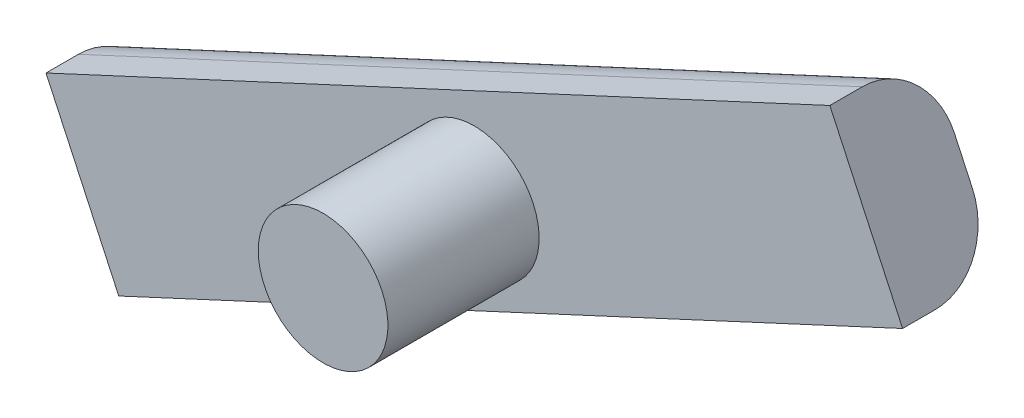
ISO-10303-21;
HEADER;
FILE_DESCRIPTION(('STEP AP214'),'2;1');
FILE_NAME('part.step','',(''),(''),'','','');
FILE_SCHEMA(('AUTOMOTIVE_DESIGN { 1 0 10303 214 1 1 1 1 }'));
ENDSEC;
DATA;
#1=APPLICATION_CONTEXT('core data for automotive mechanical design processes');
#2=APPLICATION_PROTOCOL_DEFINITION('international standard','automotive_design',2000,#1);
#3=PRODUCT_CONTEXT('',#1,'mechanical');
#4=PRODUCT('Part','Part','',(#3));
#5=PRODUCT_RELATED_PRODUCT_CATEGORY('part','',(#4));
#6=PRODUCT_DEFINITION_FORMATION('','',#4);
#7=PRODUCT_DEFINITION_CONTEXT('part definition',#1,'design');
#8=PRODUCT_DEFINITION('design','',#6,#7);
#9=PRODUCT_DEFINITION_SHAPE('','',#8);
#10=(LENGTH_UNIT() NAMED_UNIT(*) SI_UNIT(.MILLI.,.METRE.));
#11=(NAMED_UNIT(*) PLANE_ANGLE_UNIT() SI_UNIT($,.RADIAN.));
#12=(NAMED_UNIT(*) SI_UNIT($,.STERADIAN.) SOLID_ANGLE_UNIT());
#13=UNCERTAINTY_MEASURE_WITH_UNIT(LENGTH_MEASURE(1.E-05),#10,'distance_accuracy_value','');
#14=(GEOMETRIC_REPRESENTATION_CONTEXT(3) GLOBAL_UNCERTAINTY_ASSIGNED_CONTEXT((#13)) GLOBAL_UNIT_ASSIGNED_CONTEXT((#10,
#11,#12)) REPRESENTATION_CONTEXT('',''));
#15=CARTESIAN_POINT('',(0.,0.,0.));
#16=DIRECTION('',(0.,0.,1.));
#17=DIRECTION('',(1.,0.,0.));
#18=AXIS2_PLACEMENT_3D('',#15,#16,#17);
#19=CARTESIAN_POINT('',(455.341566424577,345.362620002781,22.));
#20=DIRECTION('',(0.,0.,-1.));
#21=DIRECTION('',(-1.,0.,0.));
#22=AXIS2_PLACEMENT_3D('',#19,#20,#21);
#23=PLANE('',#22);
#24=CARTESIAN_POINT('',(455.341566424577,345.362620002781,22.));
#25=DIRECTION('',(0.,0.,-1.));
#26=DIRECTION('',(-1.,0.,0.));
#27=AXIS2_PLACEMENT_3D('',#24,#25,#26);
#28=CIRCLE('',#27,3.);
#29=CARTESIAN_POINT('',(452.341566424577,345.362620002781,22.));
#30=VERTEX_POINT('',#29);
#31=EDGE_CURVE('E117',#30,#30,#28,.T.);
#32=ORIENTED_EDGE('',*,*,#31,.F.);
#33=EDGE_LOOP('',(#32));
#34=FACE_BOUND('',#33,.T.);
#35=ADVANCED_FACE('F40',(#34),#23,.F.);
#36=CARTESIAN_POINT('',(455.341566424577,345.362620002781,22.));
#37=DIRECTION('',(0.,0.,-1.));
#38=DIRECTION('',(-1.,0.,0.));
#39=AXIS2_PLACEMENT_3D('',#36,#37,#38);
#40=CYLINDRICAL_SURFACE('',#39,3.);
#41=CARTESIAN_POINT('',(455.341566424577,345.362620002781,15.));
#42=DIRECTION('',(0.,0.,-1.));
#43=DIRECTION('',(-1.,0.,0.));
#44=AXIS2_PLACEMENT_3D('',#41,#42,#43);
#45=CIRCLE('',#44,3.);
#46=CARTESIAN_POINT('',(452.341566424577,345.362620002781,15.));
#47=VERTEX_POINT('',#46);
#48=EDGE_CURVE('E120',#47,#47,#45,.T.);
#49=ORIENTED_EDGE('',*,*,#48,.F.);
#50=EDGE_LOOP('',(#49));
#51=FACE_BOUND('',#50,.T.);
#52=ORIENTED_EDGE('',*,*,#31,.T.);
#53=EDGE_LOOP('',(#52));
#54=FACE_BOUND('',#53,.T.);
#55=ADVANCED_FACE('F162',(#51,#54),#40,.T.);
#56=CARTESIAN_POINT('',(475.166946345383,350.153685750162,15.));
#57=DIRECTION('',(-0.420968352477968,0.907075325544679,0.));
#58=DIRECTION('',(-0.907075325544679,-0.420968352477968,0.));
#59=AXIS2_PLACEMENT_3D('',#56,#57,#58);
#60=PLANE('',#59);
#61=DIRECTION('',(0.,0.,-1.));
#62=VECTOR('',#61,1.);
#63=CARTESIAN_POINT('',(438.883933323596,333.314951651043,15.));
#64=LINE('',#63,#62);
#65=CARTESIAN_POINT('',(438.883933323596,333.314951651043,15.));
#66=VERTEX_POINT('',#65);
#67=CARTESIAN_POINT('',(438.883933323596,333.314951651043,13.5));
#68=VERTEX_POINT('',#67);
#69=EDGE_CURVE('E156',#66,#68,#64,.T.);
#70=ORIENTED_EDGE('',*,*,#69,.T.);
#71=DIRECTION('',(0.907075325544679,0.420968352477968,0.));
#72=VECTOR('',#71,1.);
#73=CARTESIAN_POINT('',(475.166946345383,350.153685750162,13.5));
#74=LINE('',#73,#72);
#75=CARTESIAN_POINT('',(475.166946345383,350.153685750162,13.5));
#76=VERTEX_POINT('',#75);
#77=EDGE_CURVE('E12',#68,#76,#74,.T.);
#78=ORIENTED_EDGE('',*,*,#77,.T.);
#79=DIRECTION('',(0.,0.,-1.));
#80=VECTOR('',#79,1.);
#81=CARTESIAN_POINT('',(475.166946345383,350.153685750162,15.));
#82=LINE('',#81,#80);
#83=CARTESIAN_POINT('',(475.166946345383,350.153685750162,15.));
#84=VERTEX_POINT('',#83);
#85=EDGE_CURVE('E99',#84,#76,#82,.T.);
#86=ORIENTED_EDGE('',*,*,#85,.F.);
#87=DIRECTION('',(0.907075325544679,0.420968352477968,0.));
#88=VECTOR('',#87,1.);
#89=CARTESIAN_POINT('',(475.166946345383,350.153685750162,15.));
#90=LINE('',#89,#88);
#91=EDGE_CURVE('E105',#66,#84,#90,.T.);
#92=ORIENTED_EDGE('',*,*,#91,.F.);
#93=EDGE_LOOP('',(#70,#78,#86,#92));
#94=FACE_BOUND('',#93,.T.);
#95=ADVANCED_FACE('F116',(#94),#60,.F.);
#96=CARTESIAN_POINT('',(471.799199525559,357.410288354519,15.));
#97=DIRECTION('',(-0.907075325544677,-0.420968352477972,0.));
#98=DIRECTION('',(0.420968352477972,-0.907075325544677,0.));
#99=AXIS2_PLACEMENT_3D('',#96,#97,#98);
#100=PLANE('',#99);
#101=DIRECTION('',(-0.420968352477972,0.907075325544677,0.));
#102=VECTOR('',#101,1.);
#103=CARTESIAN_POINT('',(471.799199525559,357.410288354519,10.5));
#104=LINE('',#103,#102);
#105=CARTESIAN_POINT('',(473.904041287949,352.874911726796,10.5));
#106=VERTEX_POINT('',#105);
#107=CARTESIAN_POINT('',(473.062104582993,354.689062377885,10.5));
#108=VERTEX_POINT('',#107);
#109=EDGE_CURVE('E139',#106,#108,#104,.T.);
#110=ORIENTED_EDGE('',*,*,#109,.T.);
#111=CARTESIAN_POINT('',(473.062104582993,354.689062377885,13.5));
#112=DIRECTION('',(-0.907075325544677,-0.420968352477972,0.));
#113=DIRECTION('',(0.420968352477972,-0.907075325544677,0.));
#114=AXIS2_PLACEMENT_3D('',#111,#112,#113);
#115=CIRCLE('',#114,3.);
#116=CARTESIAN_POINT('',(471.799199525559,357.410288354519,13.5));
#117=VERTEX_POINT('',#116);
#118=EDGE_CURVE('E48',#108,#117,#115,.F.);
#119=ORIENTED_EDGE('',*,*,#118,.T.);
#120=DIRECTION('',(0.,0.,-1.));
#121=VECTOR('',#120,1.);
#122=CARTESIAN_POINT('',(471.799199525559,357.410288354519,15.));
#123=LINE('',#122,#121);
#124=CARTESIAN_POINT('',(471.799199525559,357.410288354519,15.));
#125=VERTEX_POINT('',#124);
#126=EDGE_CURVE('E101',#125,#117,#123,.T.);
#127=ORIENTED_EDGE('',*,*,#126,.F.);
#128=DIRECTION('',(-0.420968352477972,0.907075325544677,0.));
#129=VECTOR('',#128,1.);
#130=CARTESIAN_POINT('',(471.799199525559,357.410288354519,15.));
#131=LINE('',#130,#129);
#132=EDGE_CURVE('E95',#84,#125,#131,.T.);
#133=ORIENTED_EDGE('',*,*,#132,.F.);
#134=ORIENTED_EDGE('',*,*,#85,.T.);
#135=CARTESIAN_POINT('',(473.904041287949,352.874911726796,13.5));
#136=DIRECTION('',(-0.907075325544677,-0.420968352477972,0.));
#137=DIRECTION('',(0.420968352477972,-0.907075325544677,0.));
#138=AXIS2_PLACEMENT_3D('',#135,#136,#137);
#139=CIRCLE('',#138,3.);
#140=EDGE_CURVE('E55',#76,#106,#139,.F.);
#141=ORIENTED_EDGE('',*,*,#140,.T.);
#142=EDGE_LOOP('',(#110,#119,#127,#133,#134,#141));
#143=FACE_BOUND('',#142,.T.);
#144=ADVANCED_FACE('F97',(#143),#100,.F.);
#145=CARTESIAN_POINT('',(435.516186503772,340.5715542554,15.));
#146=DIRECTION('',(0.420968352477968,-0.907075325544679,0.));
#147=DIRECTION('',(0.907075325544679,0.420968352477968,0.));
#148=AXIS2_PLACEMENT_3D('',#145,#146,#147);
#149=PLANE('',#148);
#150=ORIENTED_EDGE('',*,*,#126,.T.);
#151=DIRECTION('',(-0.907075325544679,-0.420968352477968,0.));
#152=VECTOR('',#151,1.);
#153=CARTESIAN_POINT('',(435.516186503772,340.5715542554,13.5));
#154=LINE('',#153,#152);
#155=CARTESIAN_POINT('',(435.516186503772,340.5715542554,13.5));
#156=VERTEX_POINT('',#155);
#157=EDGE_CURVE('E128',#117,#156,#154,.T.);
#158=ORIENTED_EDGE('',*,*,#157,.T.);
#159=DIRECTION('',(0.,0.,-1.));
#160=VECTOR('',#159,1.);
#161=CARTESIAN_POINT('',(435.516186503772,340.5715542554,15.));
#162=LINE('',#161,#160);
#163=CARTESIAN_POINT('',(435.516186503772,340.5715542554,15.));
#164=VERTEX_POINT('',#163);
#165=EDGE_CURVE('E122',#164,#156,#162,.T.);
#166=ORIENTED_EDGE('',*,*,#165,.F.);
#167=DIRECTION('',(-0.907075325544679,-0.420968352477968,0.));
#168=VECTOR('',#167,1.);
#169=CARTESIAN_POINT('',(435.516186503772,340.5715542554,15.));
#170=LINE('',#169,#168);
#171=EDGE_CURVE('E104',#125,#164,#170,.T.);
#172=ORIENTED_EDGE('',*,*,#171,.F.);
#173=EDGE_LOOP('',(#150,#158,#166,#172));
#174=FACE_BOUND('',#173,.T.);
#175=ADVANCED_FACE('F143',(#174),#149,.F.);
#176=CARTESIAN_POINT('',(438.883933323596,333.314951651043,15.));
#177=DIRECTION('',(0.907075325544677,0.420968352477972,0.));
#178=DIRECTION('',(-0.420968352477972,0.907075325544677,0.));
#179=AXIS2_PLACEMENT_3D('',#176,#177,#178);
#180=PLANE('',#179);
#181=ORIENTED_EDGE('',*,*,#165,.T.);
#182=CARTESIAN_POINT('',(436.779091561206,337.850328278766,13.5));
#183=DIRECTION('',(0.907075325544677,0.420968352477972,0.));
#184=DIRECTION('',(-0.420968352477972,0.907075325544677,0.));
#185=AXIS2_PLACEMENT_3D('',#182,#183,#184);
#186=CIRCLE('',#185,3.);
#187=CARTESIAN_POINT('',(436.779091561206,337.850328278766,10.5));
#188=VERTEX_POINT('',#187);
#189=EDGE_CURVE('E133',#156,#188,#186,.F.);
#190=ORIENTED_EDGE('',*,*,#189,.T.);
#191=DIRECTION('',(0.420968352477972,-0.907075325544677,0.));
#192=VECTOR('',#191,1.);
#193=CARTESIAN_POINT('',(438.883933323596,333.314951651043,10.5));
#194=LINE('',#193,#192);
#195=CARTESIAN_POINT('',(437.621028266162,336.036177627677,10.5));
#196=VERTEX_POINT('',#195);
#197=EDGE_CURVE('E114',#188,#196,#194,.T.);
#198=ORIENTED_EDGE('',*,*,#197,.T.);
#199=CARTESIAN_POINT('',(437.621028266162,336.036177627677,13.5));
#200=DIRECTION('',(0.907075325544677,0.420968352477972,0.));
#201=DIRECTION('',(-0.420968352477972,0.907075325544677,0.));
#202=AXIS2_PLACEMENT_3D('',#199,#200,#201);
#203=CIRCLE('',#202,3.);
#204=EDGE_CURVE('E131',#196,#68,#203,.F.);
#205=ORIENTED_EDGE('',*,*,#204,.T.);
#206=ORIENTED_EDGE('',*,*,#69,.F.);
#207=DIRECTION('',(0.420968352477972,-0.907075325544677,0.));
#208=VECTOR('',#207,1.);
#209=CARTESIAN_POINT('',(438.883933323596,333.314951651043,15.));
#210=LINE('',#209,#208);
#211=EDGE_CURVE('E110',#164,#66,#210,.T.);
#212=ORIENTED_EDGE('',*,*,#211,.F.);
#213=EDGE_LOOP('',(#181,#190,#198,#205,#206,#212));
#214=FACE_BOUND('',#213,.T.);
#215=ADVANCED_FACE('F149',(#214),#180,.F.);
#216=CARTESIAN_POINT('',(0.,0.,15.));
#217=DIRECTION('',(0.,0.,-1.));
#218=DIRECTION('',(-1.,0.,0.));
#219=AXIS2_PLACEMENT_3D('',#216,#217,#218);
#220=PLANE('',#219);
#221=ORIENTED_EDGE('',*,*,#48,.T.);
#222=EDGE_LOOP('',(#221));
#223=FACE_BOUND('',#222,.T.);
#224=ORIENTED_EDGE('',*,*,#91,.T.);
#225=ORIENTED_EDGE('',*,*,#132,.T.);
#226=ORIENTED_EDGE('',*,*,#171,.T.);
#227=ORIENTED_EDGE('',*,*,#211,.T.);
#228=EDGE_LOOP('',(#224,#225,#226,#227));
#229=FACE_BOUND('',#228,.T.);
#230=ADVANCED_FACE('F108',(#223,#229),#220,.F.);
#231=CARTESIAN_POINT('',(0.,0.,10.5));
#232=DIRECTION('',(0.,0.,-1.));
#233=DIRECTION('',(-1.,0.,0.));
#234=AXIS2_PLACEMENT_3D('',#231,#232,#233);
#235=PLANE('',#234);
#236=ORIENTED_EDGE('',*,*,#197,.F.);
#237=DIRECTION('',(-0.907075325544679,-0.420968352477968,0.));
#238=VECTOR('',#237,1.);
#239=CARTESIAN_POINT('',(473.062104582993,354.689062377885,10.5));
#240=LINE('',#239,#238);
#241=EDGE_CURVE('E62',#188,#108,#240,.F.);
#242=ORIENTED_EDGE('',*,*,#241,.T.);
#243=ORIENTED_EDGE('',*,*,#109,.F.);
#244=DIRECTION('',(0.907075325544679,0.420968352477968,0.));
#245=VECTOR('',#244,1.);
#246=CARTESIAN_POINT('',(437.621028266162,336.036177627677,10.5));
#247=LINE('',#246,#245);
#248=EDGE_CURVE('E135',#106,#196,#247,.F.);
#249=ORIENTED_EDGE('',*,*,#248,.T.);
#250=EDGE_LOOP('',(#236,#242,#243,#249));
#251=FACE_BOUND('',#250,.T.);
#252=ADVANCED_FACE('F151',(#251),#235,.T.);
#253=CARTESIAN_POINT('',(436.779091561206,337.850328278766,13.5));
#254=DIRECTION('',(0.907075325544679,0.420968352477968,0.));
#255=DIRECTION('',(-0.420968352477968,0.907075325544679,0.));
#256=AXIS2_PLACEMENT_3D('',#253,#254,#255);
#257=CYLINDRICAL_SURFACE('',#256,3.);
#258=ORIENTED_EDGE('',*,*,#118,.F.);
#259=ORIENTED_EDGE('',*,*,#241,.F.);
#260=ORIENTED_EDGE('',*,*,#189,.F.);
#261=ORIENTED_EDGE('',*,*,#157,.F.);
#262=EDGE_LOOP('',(#258,#259,#260,#261));
#263=FACE_BOUND('',#262,.T.);
#264=ADVANCED_FACE('F146',(#263),#257,.T.);
#265=CARTESIAN_POINT('',(473.904041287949,352.874911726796,13.5));
#266=DIRECTION('',(-0.907075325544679,-0.420968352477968,0.));
#267=DIRECTION('',(0.420968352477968,-0.907075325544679,0.));
#268=AXIS2_PLACEMENT_3D('',#265,#266,#267);
#269=CYLINDRICAL_SURFACE('',#268,3.);
#270=ORIENTED_EDGE('',*,*,#204,.F.);
#271=ORIENTED_EDGE('',*,*,#248,.F.);
#272=ORIENTED_EDGE('',*,*,#140,.F.);
#273=ORIENTED_EDGE('',*,*,#77,.F.);
#274=EDGE_LOOP('',(#270,#271,#272,#273));
#275=FACE_BOUND('',#274,.T.);
#276=ADVANCED_FACE('F42',(#275),#269,.T.);
#277=CLOSED_SHELL('',(#35,#55,#95,#144,#175,#215,#230,#252,#264,#276));
#278=MANIFOLD_SOLID_BREP('B2',#277);
#279=ADVANCED_BREP_SHAPE_REPRESENTATION('',(#18,#278),#14);
#280=SHAPE_DEFINITION_REPRESENTATION(#9,#279);
ENDSEC;
END-ISO-10303-21;
